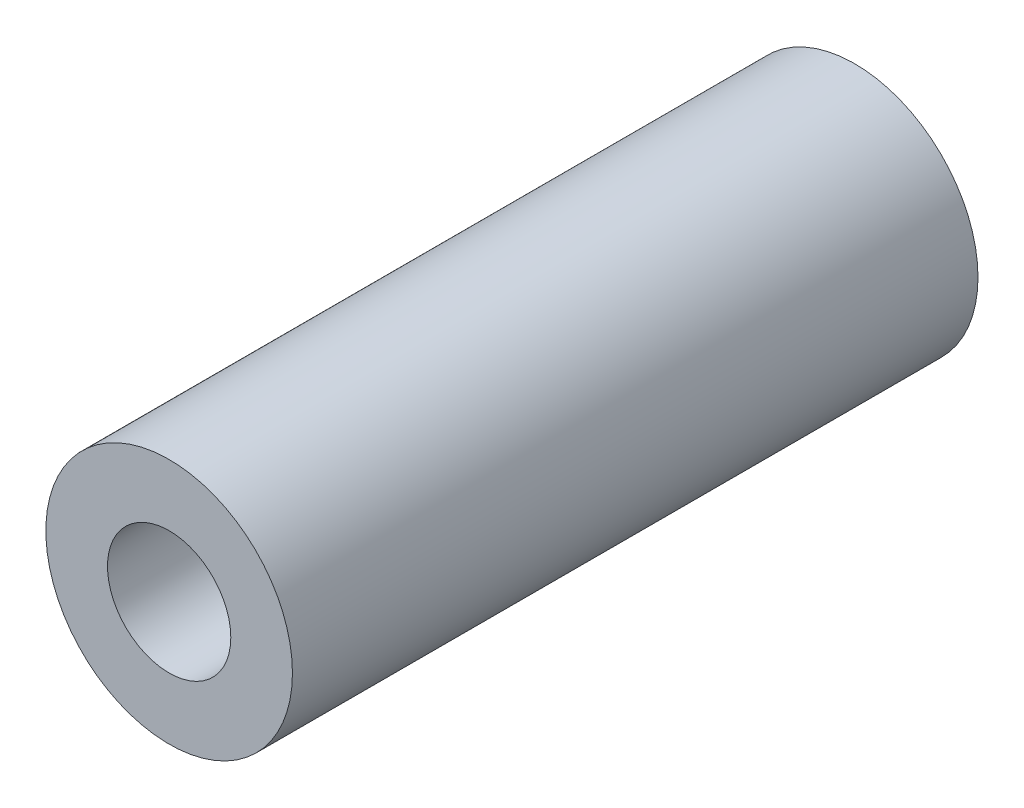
ISO-10303-21;
HEADER;
FILE_DESCRIPTION(('STEP AP214'),'2;1');
FILE_NAME('part.step','',(''),(''),'','','');
FILE_SCHEMA(('AUTOMOTIVE_DESIGN { 1 0 10303 214 1 1 1 1 }'));
ENDSEC;
DATA;
#1=APPLICATION_CONTEXT('core data for automotive mechanical design processes');
#2=APPLICATION_PROTOCOL_DEFINITION('international standard','automotive_design',2000,#1);
#3=PRODUCT_CONTEXT('',#1,'mechanical');
#4=PRODUCT('Part','Part','',(#3));
#5=PRODUCT_RELATED_PRODUCT_CATEGORY('part','',(#4));
#6=PRODUCT_DEFINITION_FORMATION('','',#4);
#7=PRODUCT_DEFINITION_CONTEXT('part definition',#1,'design');
#8=PRODUCT_DEFINITION('design','',#6,#7);
#9=PRODUCT_DEFINITION_SHAPE('','',#8);
#10=(LENGTH_UNIT() NAMED_UNIT(*) SI_UNIT(.MILLI.,.METRE.));
#11=(NAMED_UNIT(*) PLANE_ANGLE_UNIT() SI_UNIT($,.RADIAN.));
#12=(NAMED_UNIT(*) SI_UNIT($,.STERADIAN.) SOLID_ANGLE_UNIT());
#13=UNCERTAINTY_MEASURE_WITH_UNIT(LENGTH_MEASURE(1.E-05),#10,'distance_accuracy_value','');
#14=(GEOMETRIC_REPRESENTATION_CONTEXT(3) GLOBAL_UNCERTAINTY_ASSIGNED_CONTEXT((#13)) GLOBAL_UNIT_ASSIGNED_CONTEXT((#10,
#11,#12)) REPRESENTATION_CONTEXT('',''));
#15=CARTESIAN_POINT('',(0.,0.,0.));
#16=DIRECTION('',(0.,0.,1.));
#17=DIRECTION('',(1.,0.,0.));
#18=AXIS2_PLACEMENT_3D('',#15,#16,#17);
#19=CARTESIAN_POINT('',(0.,0.,139.));
#20=DIRECTION('',(0.,0.,1.));
#21=DIRECTION('',(1.,0.,0.));
#22=AXIS2_PLACEMENT_3D('',#19,#20,#21);
#23=PLANE('',#22);
#24=CARTESIAN_POINT('',(0.,0.,139.));
#25=DIRECTION('',(0.,0.,1.));
#26=DIRECTION('',(1.,0.,0.));
#27=AXIS2_PLACEMENT_3D('',#24,#25,#26);
#28=CIRCLE('',#27,25.);
#29=CARTESIAN_POINT('',(25.,0.,139.));
#30=VERTEX_POINT('',#29);
#31=EDGE_CURVE('E9',#30,#30,#28,.T.);
#32=ORIENTED_EDGE('',*,*,#31,.T.);
#33=EDGE_LOOP('',(#32));
#34=FACE_BOUND('',#33,.T.);
#35=CARTESIAN_POINT('',(0.,0.,139.));
#36=DIRECTION('',(0.,0.,1.));
#37=DIRECTION('',(1.,0.,0.));
#38=AXIS2_PLACEMENT_3D('',#35,#36,#37);
#39=CIRCLE('',#38,12.5);
#40=CARTESIAN_POINT('',(12.5,0.,139.));
#41=VERTEX_POINT('',#40);
#42=EDGE_CURVE('E25',#41,#41,#39,.T.);
#43=ORIENTED_EDGE('',*,*,#42,.F.);
#44=EDGE_LOOP('',(#43));
#45=FACE_BOUND('',#44,.T.);
#46=ADVANCED_FACE('F14',(#34,#45),#23,.T.);
#47=CARTESIAN_POINT('',(0.,0.,0.));
#48=DIRECTION('',(0.,0.,1.));
#49=DIRECTION('',(1.,0.,0.));
#50=AXIS2_PLACEMENT_3D('',#47,#48,#49);
#51=PLANE('',#50);
#52=CARTESIAN_POINT('',(0.,0.,0.));
#53=DIRECTION('',(0.,0.,1.));
#54=DIRECTION('',(1.,0.,0.));
#55=AXIS2_PLACEMENT_3D('',#52,#53,#54);
#56=CIRCLE('',#55,25.);
#57=CARTESIAN_POINT('',(25.,0.,0.));
#58=VERTEX_POINT('',#57);
#59=EDGE_CURVE('E18',#58,#58,#56,.T.);
#60=ORIENTED_EDGE('',*,*,#59,.F.);
#61=EDGE_LOOP('',(#60));
#62=FACE_BOUND('',#61,.T.);
#63=CARTESIAN_POINT('',(0.,0.,0.));
#64=DIRECTION('',(0.,0.,1.));
#65=DIRECTION('',(1.,0.,0.));
#66=AXIS2_PLACEMENT_3D('',#63,#64,#65);
#67=CIRCLE('',#66,12.5);
#68=CARTESIAN_POINT('',(12.5,0.,0.));
#69=VERTEX_POINT('',#68);
#70=EDGE_CURVE('E27',#69,#69,#67,.T.);
#71=ORIENTED_EDGE('',*,*,#70,.T.);
#72=EDGE_LOOP('',(#71));
#73=FACE_BOUND('',#72,.T.);
#74=ADVANCED_FACE('F37',(#62,#73),#51,.F.);
#75=CARTESIAN_POINT('',(0.,0.,139.));
#76=DIRECTION('',(0.,0.,-1.));
#77=DIRECTION('',(-1.,0.,0.));
#78=AXIS2_PLACEMENT_3D('',#75,#76,#77);
#79=CYLINDRICAL_SURFACE('',#78,25.);
#80=ORIENTED_EDGE('',*,*,#31,.F.);
#81=EDGE_LOOP('',(#80));
#82=FACE_BOUND('',#81,.T.);
#83=ORIENTED_EDGE('',*,*,#59,.T.);
#84=EDGE_LOOP('',(#83));
#85=FACE_BOUND('',#84,.T.);
#86=ADVANCED_FACE('F16',(#82,#85),#79,.T.);
#87=CARTESIAN_POINT('',(0.,0.,139.));
#88=DIRECTION('',(0.,0.,-1.));
#89=DIRECTION('',(-1.,0.,0.));
#90=AXIS2_PLACEMENT_3D('',#87,#88,#89);
#91=CYLINDRICAL_SURFACE('',#90,12.5);
#92=ORIENTED_EDGE('',*,*,#42,.T.);
#93=EDGE_LOOP('',(#92));
#94=FACE_BOUND('',#93,.T.);
#95=ORIENTED_EDGE('',*,*,#70,.F.);
#96=EDGE_LOOP('',(#95));
#97=FACE_BOUND('',#96,.T.);
#98=ADVANCED_FACE('F33',(#94,#97),#91,.F.);
#99=CLOSED_SHELL('',(#46,#74,#86,#98));
#100=MANIFOLD_SOLID_BREP('B1',#99);
#101=ADVANCED_BREP_SHAPE_REPRESENTATION('',(#18,#100),#14);
#102=SHAPE_DEFINITION_REPRESENTATION(#9,#101);
ENDSEC;
END-ISO-10303-21;
